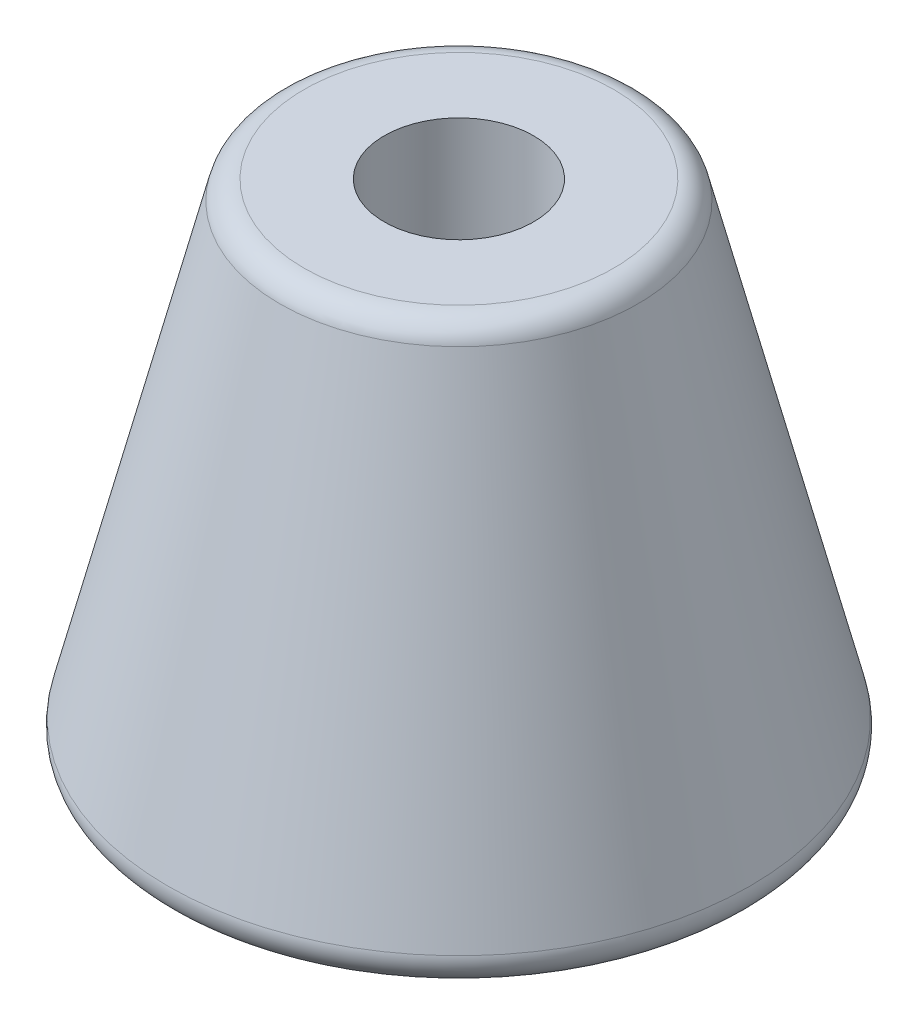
ISO-10303-21;
HEADER;
FILE_DESCRIPTION(('STEP AP214'),'2;1');
FILE_NAME('part.step','',(''),(''),'','','');
FILE_SCHEMA(('AUTOMOTIVE_DESIGN { 1 0 10303 214 1 1 1 1 }'));
ENDSEC;
DATA;
#1=APPLICATION_CONTEXT('core data for automotive mechanical design processes');
#2=APPLICATION_PROTOCOL_DEFINITION('international standard','automotive_design',2000,#1);
#3=PRODUCT_CONTEXT('',#1,'mechanical');
#4=PRODUCT('Part','Part','',(#3));
#5=PRODUCT_RELATED_PRODUCT_CATEGORY('part','',(#4));
#6=PRODUCT_DEFINITION_FORMATION('','',#4);
#7=PRODUCT_DEFINITION_CONTEXT('part definition',#1,'design');
#8=PRODUCT_DEFINITION('design','',#6,#7);
#9=PRODUCT_DEFINITION_SHAPE('','',#8);
#10=(LENGTH_UNIT() NAMED_UNIT(*) SI_UNIT(.MILLI.,.METRE.));
#11=(NAMED_UNIT(*) PLANE_ANGLE_UNIT() SI_UNIT($,.RADIAN.));
#12=(NAMED_UNIT(*) SI_UNIT($,.STERADIAN.) SOLID_ANGLE_UNIT());
#13=UNCERTAINTY_MEASURE_WITH_UNIT(LENGTH_MEASURE(1.E-05),#10,'distance_accuracy_value','');
#14=(GEOMETRIC_REPRESENTATION_CONTEXT(3) GLOBAL_UNCERTAINTY_ASSIGNED_CONTEXT((#13)) GLOBAL_UNIT_ASSIGNED_CONTEXT((#10,
#11,#12)) REPRESENTATION_CONTEXT('',''));
#15=CARTESIAN_POINT('',(0.,0.,0.));
#16=DIRECTION('',(0.,0.,1.));
#17=DIRECTION('',(1.,0.,0.));
#18=AXIS2_PLACEMENT_3D('',#15,#16,#17);
#19=CARTESIAN_POINT('',(0.,0.999999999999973,0.));
#20=DIRECTION('',(0.,-1.,0.));
#21=DIRECTION('',(0.,0.,-1.));
#22=AXIS2_PLACEMENT_3D('',#19,#20,#21);
#23=TOROIDAL_SURFACE('',#22,10.7192235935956,0.999999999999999);
#24=CARTESIAN_POINT('',(-2.22044604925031E-13,1.24253562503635,2.22044604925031E-13));
#25=DIRECTION('',(0.,-1.,0.));
#26=DIRECTION('',(0.,0.,-1.));
#27=AXIS2_PLACEMENT_3D('',#24,#25,#26);
#28=CIRCLE('',#27,11.6893660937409);
#29=CARTESIAN_POINT('',(-2.22044604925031E-13,1.24253562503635,-11.6893660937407));
#30=VERTEX_POINT('',#29);
#31=EDGE_CURVE('E10',#30,#30,#28,.T.);
#32=ORIENTED_EDGE('',*,*,#31,.T.);
#33=EDGE_LOOP('',(#32));
#34=FACE_BOUND('',#33,.T.);
#35=CARTESIAN_POINT('',(0.,0.,0.));
#36=DIRECTION('',(0.,-1.,0.));
#37=DIRECTION('',(0.,0.,-1.));
#38=AXIS2_PLACEMENT_3D('',#35,#36,#37);
#39=CIRCLE('',#38,10.7192235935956);
#40=CARTESIAN_POINT('',(0.,0.,-10.7192235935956));
#41=VERTEX_POINT('',#40);
#42=EDGE_CURVE('E54',#41,#41,#39,.T.);
#43=ORIENTED_EDGE('',*,*,#42,.F.);
#44=EDGE_LOOP('',(#43));
#45=FACE_BOUND('',#44,.T.);
#46=ADVANCED_FACE('F29',(#34,#45),#23,.T.);
#47=CARTESIAN_POINT('',(-2.22044604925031E-13,1.24253562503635,2.22044604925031E-13));
#48=DIRECTION('',(0.,-1.,0.));
#49=DIRECTION('',(0.,0.,-1.));
#50=AXIS2_PLACEMENT_3D('',#47,#48,#49);
#51=CONICAL_SURFACE('',#50,11.6893660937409,0.244978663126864);
#52=CARTESIAN_POINT('',(2.22044604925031E-13,19.2425356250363,0.));
#53=DIRECTION('',(0.,-1.,0.));
#54=DIRECTION('',(0.,0.,-1.));
#55=AXIS2_PLACEMENT_3D('',#52,#53,#54);
#56=CIRCLE('',#55,7.18936609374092);
#57=CARTESIAN_POINT('',(2.22044604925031E-13,19.2425356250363,-7.18936609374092));
#58=VERTEX_POINT('',#57);
#59=EDGE_CURVE('E35',#58,#58,#56,.T.);
#60=ORIENTED_EDGE('',*,*,#59,.T.);
#61=EDGE_LOOP('',(#60));
#62=FACE_BOUND('',#61,.T.);
#63=ORIENTED_EDGE('',*,*,#31,.F.);
#64=EDGE_LOOP('',(#63));
#65=FACE_BOUND('',#64,.T.);
#66=ADVANCED_FACE('F62',(#62,#65),#51,.T.);
#67=CARTESIAN_POINT('',(0.,19.,0.));
#68=DIRECTION('',(0.,-1.,0.));
#69=DIRECTION('',(0.,0.,-1.));
#70=AXIS2_PLACEMENT_3D('',#67,#68,#69);
#71=TOROIDAL_SURFACE('',#70,6.21922359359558,1.);
#72=CARTESIAN_POINT('',(-2.22044604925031E-13,20.,2.22044604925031E-13));
#73=DIRECTION('',(0.,-1.,0.));
#74=DIRECTION('',(0.,0.,-1.));
#75=AXIS2_PLACEMENT_3D('',#72,#73,#74);
#76=CIRCLE('',#75,6.21922359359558);
#77=CARTESIAN_POINT('',(-2.22044604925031E-13,20.,-6.21922359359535));
#78=VERTEX_POINT('',#77);
#79=EDGE_CURVE('E39',#78,#78,#76,.T.);
#80=ORIENTED_EDGE('',*,*,#79,.T.);
#81=EDGE_LOOP('',(#80));
#82=FACE_BOUND('',#81,.T.);
#83=ORIENTED_EDGE('',*,*,#59,.F.);
#84=EDGE_LOOP('',(#83));
#85=FACE_BOUND('',#84,.T.);
#86=ADVANCED_FACE('F66',(#82,#85),#71,.T.);
#87=CARTESIAN_POINT('',(6.21922359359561,20.,-2.22044604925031E-13));
#88=DIRECTION('',(0.,1.,0.));
#89=DIRECTION('',(0.,0.,1.));
#90=AXIS2_PLACEMENT_3D('',#87,#88,#89);
#91=PLANE('',#90);
#92=CARTESIAN_POINT('',(-2.22044604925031E-13,20.,2.22044604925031E-13));
#93=DIRECTION('',(0.,-1.,0.));
#94=DIRECTION('',(0.,0.,-1.));
#95=AXIS2_PLACEMENT_3D('',#92,#93,#94);
#96=CIRCLE('',#95,3.);
#97=CARTESIAN_POINT('',(-2.22044604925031E-13,20.,-2.99999999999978));
#98=VERTEX_POINT('',#97);
#99=EDGE_CURVE('E43',#98,#98,#96,.T.);
#100=ORIENTED_EDGE('',*,*,#99,.T.);
#101=EDGE_LOOP('',(#100));
#102=FACE_BOUND('',#101,.T.);
#103=ORIENTED_EDGE('',*,*,#79,.F.);
#104=EDGE_LOOP('',(#103));
#105=FACE_BOUND('',#104,.T.);
#106=ADVANCED_FACE('F70',(#102,#105),#91,.T.);
#107=CARTESIAN_POINT('',(0.,0.,0.));
#108=DIRECTION('',(0.,-1.,0.));
#109=DIRECTION('',(0.,0.,-1.));
#110=AXIS2_PLACEMENT_3D('',#107,#108,#109);
#111=CYLINDRICAL_SURFACE('',#110,3.);
#112=CARTESIAN_POINT('',(0.,0.999999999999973,0.));
#113=DIRECTION('',(0.,-1.,0.));
#114=DIRECTION('',(0.,0.,-1.));
#115=AXIS2_PLACEMENT_3D('',#112,#113,#114);
#116=CIRCLE('',#115,3.);
#117=CARTESIAN_POINT('',(0.,0.999999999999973,-3.));
#118=VERTEX_POINT('',#117);
#119=EDGE_CURVE('E48',#118,#118,#116,.T.);
#120=ORIENTED_EDGE('',*,*,#119,.T.);
#121=EDGE_LOOP('',(#120));
#122=FACE_BOUND('',#121,.T.);
#123=ORIENTED_EDGE('',*,*,#99,.F.);
#124=EDGE_LOOP('',(#123));
#125=FACE_BOUND('',#124,.T.);
#126=ADVANCED_FACE('F77',(#122,#125),#111,.F.);
#127=CARTESIAN_POINT('',(0.,0.999999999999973,0.));
#128=DIRECTION('',(0.,-1.,0.));
#129=DIRECTION('',(0.,0.,-1.));
#130=AXIS2_PLACEMENT_3D('',#127,#128,#129);
#131=CONICAL_SURFACE('',#130,3.,0.785398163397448);
#132=CARTESIAN_POINT('',(0.,0.,0.));
#133=DIRECTION('',(0.,-1.,0.));
#134=DIRECTION('',(0.,0.,-1.));
#135=AXIS2_PLACEMENT_3D('',#132,#133,#134);
#136=CIRCLE('',#135,4.);
#137=CARTESIAN_POINT('',(0.,0.,-4.));
#138=VERTEX_POINT('',#137);
#139=EDGE_CURVE('E51',#138,#138,#136,.T.);
#140=ORIENTED_EDGE('',*,*,#139,.T.);
#141=EDGE_LOOP('',(#140));
#142=FACE_BOUND('',#141,.T.);
#143=ORIENTED_EDGE('',*,*,#119,.F.);
#144=EDGE_LOOP('',(#143));
#145=FACE_BOUND('',#144,.T.);
#146=ADVANCED_FACE('F81',(#142,#145),#131,.F.);
#147=CARTESIAN_POINT('',(3.99999999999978,0.,2.22044604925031E-13));
#148=DIRECTION('',(0.,-1.,0.));
#149=DIRECTION('',(0.,0.,-1.));
#150=AXIS2_PLACEMENT_3D('',#147,#148,#149);
#151=PLANE('',#150);
#152=ORIENTED_EDGE('',*,*,#42,.T.);
#153=EDGE_LOOP('',(#152));
#154=FACE_BOUND('',#153,.T.);
#155=ORIENTED_EDGE('',*,*,#139,.F.);
#156=EDGE_LOOP('',(#155));
#157=FACE_BOUND('',#156,.T.);
#158=ADVANCED_FACE('F58',(#154,#157),#151,.T.);
#159=CLOSED_SHELL('',(#46,#66,#86,#106,#126,#146,#158));
#160=MANIFOLD_SOLID_BREP('B2',#159);
#161=ADVANCED_BREP_SHAPE_REPRESENTATION('',(#18,#160),#14);
#162=SHAPE_DEFINITION_REPRESENTATION(#9,#161);
ENDSEC;
END-ISO-10303-21;
